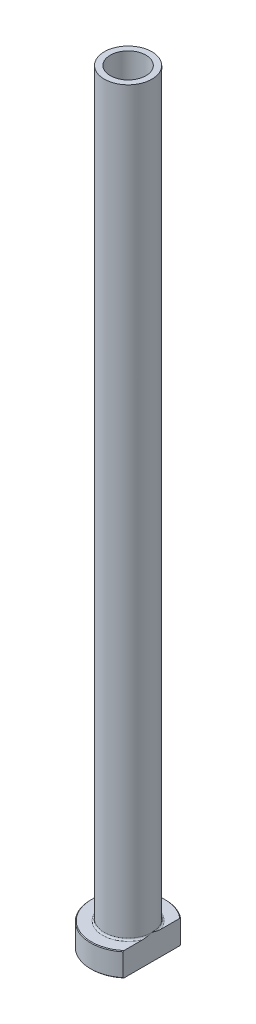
ISO-10303-21;
HEADER;
FILE_DESCRIPTION(('STEP AP214'),'2;1');
FILE_NAME('part.step','',(''),(''),'','','');
FILE_SCHEMA(('AUTOMOTIVE_DESIGN { 1 0 10303 214 1 1 1 1 }'));
ENDSEC;
DATA;
#1=APPLICATION_CONTEXT('core data for automotive mechanical design processes');
#2=APPLICATION_PROTOCOL_DEFINITION('international standard','automotive_design',2000,#1);
#3=PRODUCT_CONTEXT('',#1,'mechanical');
#4=PRODUCT('Part','Part','',(#3));
#5=PRODUCT_RELATED_PRODUCT_CATEGORY('part','',(#4));
#6=PRODUCT_DEFINITION_FORMATION('','',#4);
#7=PRODUCT_DEFINITION_CONTEXT('part definition',#1,'design');
#8=PRODUCT_DEFINITION('design','',#6,#7);
#9=PRODUCT_DEFINITION_SHAPE('','',#8);
#10=(LENGTH_UNIT() NAMED_UNIT(*) SI_UNIT(.MILLI.,.METRE.));
#11=(NAMED_UNIT(*) PLANE_ANGLE_UNIT() SI_UNIT($,.RADIAN.));
#12=(NAMED_UNIT(*) SI_UNIT($,.STERADIAN.) SOLID_ANGLE_UNIT());
#13=UNCERTAINTY_MEASURE_WITH_UNIT(LENGTH_MEASURE(1.E-05),#10,'distance_accuracy_value','');
#14=(GEOMETRIC_REPRESENTATION_CONTEXT(3) GLOBAL_UNCERTAINTY_ASSIGNED_CONTEXT((#13)) GLOBAL_UNIT_ASSIGNED_CONTEXT((#10,
#11,#12)) REPRESENTATION_CONTEXT('',''));
#15=CARTESIAN_POINT('',(0.,0.,0.));
#16=DIRECTION('',(0.,0.,1.));
#17=DIRECTION('',(1.,0.,0.));
#18=AXIS2_PLACEMENT_3D('',#15,#16,#17);
#19=CARTESIAN_POINT('',(0.,92.1876809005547,0.));
#20=DIRECTION('',(0.,1.,0.));
#21=DIRECTION('',(0.,0.,1.));
#22=AXIS2_PLACEMENT_3D('',#19,#20,#21);
#23=CYLINDRICAL_SURFACE('',#22,5.25000000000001);
#24=CARTESIAN_POINT('',(0.,225.,0.));
#25=DIRECTION('',(0.,1.,0.));
#26=DIRECTION('',(0.,0.,1.));
#27=AXIS2_PLACEMENT_3D('',#24,#25,#26);
#28=CIRCLE('',#27,5.25000000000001);
#29=CARTESIAN_POINT('',(0.,225.,5.25000000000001));
#30=VERTEX_POINT('',#29);
#31=EDGE_CURVE('E167',#30,#30,#28,.T.);
#32=ORIENTED_EDGE('',*,*,#31,.T.);
#33=EDGE_LOOP('',(#32));
#34=FACE_BOUND('',#33,.T.);
#35=CARTESIAN_POINT('',(0.,170.,0.));
#36=DIRECTION('',(0.,1.,0.));
#37=DIRECTION('',(0.,0.,1.));
#38=AXIS2_PLACEMENT_3D('',#35,#36,#37);
#39=CIRCLE('',#38,5.25000000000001);
#40=CARTESIAN_POINT('',(0.,170.,5.25000000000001));
#41=VERTEX_POINT('',#40);
#42=EDGE_CURVE('E170',#41,#41,#39,.T.);
#43=ORIENTED_EDGE('',*,*,#42,.F.);
#44=EDGE_LOOP('',(#43));
#45=FACE_BOUND('',#44,.T.);
#46=ADVANCED_FACE('F32',(#34,#45),#23,.F.);
#47=CARTESIAN_POINT('',(-5.25000000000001,225.,0.));
#48=DIRECTION('',(0.,1.,0.));
#49=DIRECTION('',(0.,0.,1.));
#50=AXIS2_PLACEMENT_3D('',#47,#48,#49);
#51=PLANE('',#50);
#52=CARTESIAN_POINT('',(0.,225.,0.));
#53=DIRECTION('',(0.,1.,0.));
#54=DIRECTION('',(0.,0.,1.));
#55=AXIS2_PLACEMENT_3D('',#52,#53,#54);
#56=CIRCLE('',#55,7.00000000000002);
#57=CARTESIAN_POINT('',(0.,225.,7.00000000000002));
#58=VERTEX_POINT('',#57);
#59=EDGE_CURVE('E174',#58,#58,#56,.T.);
#60=ORIENTED_EDGE('',*,*,#59,.T.);
#61=EDGE_LOOP('',(#60));
#62=FACE_BOUND('',#61,.T.);
#63=ORIENTED_EDGE('',*,*,#31,.F.);
#64=EDGE_LOOP('',(#63));
#65=FACE_BOUND('',#64,.T.);
#66=ADVANCED_FACE('F157',(#62,#65),#51,.T.);
#67=CARTESIAN_POINT('',(0.,92.1876809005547,0.));
#68=DIRECTION('',(0.,1.,0.));
#69=DIRECTION('',(0.,0.,1.));
#70=AXIS2_PLACEMENT_3D('',#67,#68,#69);
#71=CYLINDRICAL_SURFACE('',#70,7.);
#72=CARTESIAN_POINT('',(0.,7.50000000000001,0.));
#73=DIRECTION('',(0.,1.,0.));
#74=DIRECTION('',(0.,0.,1.));
#75=AXIS2_PLACEMENT_3D('',#72,#73,#74);
#76=CIRCLE('',#75,7.);
#77=CARTESIAN_POINT('',(7.,7.50000000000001,0.));
#78=VERTEX_POINT('',#77);
#79=EDGE_CURVE('E180',#78,#78,#76,.T.);
#80=ORIENTED_EDGE('',*,*,#79,.T.);
#81=EDGE_LOOP('',(#80));
#82=FACE_BOUND('',#81,.T.);
#83=ORIENTED_EDGE('',*,*,#59,.F.);
#84=EDGE_LOOP('',(#83));
#85=FACE_BOUND('',#84,.T.);
#86=ADVANCED_FACE('F162',(#82,#85),#71,.T.);
#87=CARTESIAN_POINT('',(-6.99999999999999,7.,0.));
#88=DIRECTION('',(0.,1.,0.));
#89=DIRECTION('',(0.,0.,1.));
#90=AXIS2_PLACEMENT_3D('',#87,#88,#89);
#91=PLANE('',#90);
#92=DIRECTION('',(0.,0.,1.));
#93=VECTOR('',#92,1.);
#94=CARTESIAN_POINT('',(6.99999999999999,7.,0.));
#95=LINE('',#94,#93);
#96=CARTESIAN_POINT('',(7.,7.,-8.22435407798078));
#97=VERTEX_POINT('',#96);
#98=CARTESIAN_POINT('',(6.99999999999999,7.,-2.69258240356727));
#99=VERTEX_POINT('',#98);
#100=EDGE_CURVE('E54',#97,#99,#95,.T.);
#101=ORIENTED_EDGE('',*,*,#100,.F.);
#102=CARTESIAN_POINT('',(0.,7.,0.));
#103=DIRECTION('',(0.,1.,0.));
#104=DIRECTION('',(0.,0.,1.));
#105=AXIS2_PLACEMENT_3D('',#102,#103,#104);
#106=CIRCLE('',#105,10.8);
#107=CARTESIAN_POINT('',(6.99999999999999,7.,8.22435407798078));
#108=VERTEX_POINT('',#107);
#109=EDGE_CURVE('E186',#97,#108,#106,.T.);
#110=ORIENTED_EDGE('',*,*,#109,.T.);
#111=CARTESIAN_POINT('',(6.99999999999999,7.,2.69258240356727));
#112=VERTEX_POINT('',#111);
#113=EDGE_CURVE('E134',#112,#108,#95,.T.);
#114=ORIENTED_EDGE('',*,*,#113,.F.);
#115=CARTESIAN_POINT('',(0.,7.,0.));
#116=DIRECTION('',(0.,1.,0.));
#117=DIRECTION('',(0.,0.,1.));
#118=AXIS2_PLACEMENT_3D('',#115,#116,#117);
#119=CIRCLE('',#118,7.5);
#120=EDGE_CURVE('E183',#112,#99,#119,.F.);
#121=ORIENTED_EDGE('',*,*,#120,.T.);
#122=EDGE_LOOP('',(#101,#110,#114,#121));
#123=FACE_BOUND('',#122,.T.);
#124=ADVANCED_FACE('F197',(#123),#91,.T.);
#125=CARTESIAN_POINT('',(0.,92.1876809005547,0.));
#126=DIRECTION('',(0.,1.,0.));
#127=DIRECTION('',(0.,0.,1.));
#128=AXIS2_PLACEMENT_3D('',#125,#126,#127);
#129=CYLINDRICAL_SURFACE('',#128,11.);
#130=DIRECTION('',(0.,-1.,0.));
#131=VECTOR('',#130,1.);
#132=CARTESIAN_POINT('',(6.99999999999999,225.,8.48528137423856));
#133=LINE('',#132,#131);
#134=CARTESIAN_POINT('',(6.99999999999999,6.79999999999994,8.48528137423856));
#135=VERTEX_POINT('',#134);
#136=CARTESIAN_POINT('',(6.99999999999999,0.200000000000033,8.48528137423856));
#137=VERTEX_POINT('',#136);
#138=EDGE_CURVE('E82',#135,#137,#133,.T.);
#139=ORIENTED_EDGE('',*,*,#138,.F.);
#140=CARTESIAN_POINT('',(0.,6.79999999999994,0.));
#141=DIRECTION('',(0.,1.,0.));
#142=DIRECTION('',(0.,0.,1.));
#143=AXIS2_PLACEMENT_3D('',#140,#141,#142);
#144=CIRCLE('',#143,11.);
#145=CARTESIAN_POINT('',(7.,6.79999999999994,-8.48528137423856));
#146=VERTEX_POINT('',#145);
#147=EDGE_CURVE('E95',#135,#146,#144,.F.);
#148=ORIENTED_EDGE('',*,*,#147,.T.);
#149=DIRECTION('',(0.,-1.,0.));
#150=VECTOR('',#149,1.);
#151=CARTESIAN_POINT('',(7.,225.,-8.48528137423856));
#152=LINE('',#151,#150);
#153=CARTESIAN_POINT('',(7.,0.200000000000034,-8.48528137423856));
#154=VERTEX_POINT('',#153);
#155=EDGE_CURVE('E192',#146,#154,#152,.T.);
#156=ORIENTED_EDGE('',*,*,#155,.T.);
#157=CARTESIAN_POINT('',(0.,0.200000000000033,0.));
#158=DIRECTION('',(0.,-1.,0.));
#159=DIRECTION('',(0.,0.,-1.));
#160=AXIS2_PLACEMENT_3D('',#157,#158,#159);
#161=CIRCLE('',#160,11.);
#162=EDGE_CURVE('E98',#154,#137,#161,.F.);
#163=ORIENTED_EDGE('',*,*,#162,.T.);
#164=EDGE_LOOP('',(#139,#148,#156,#163));
#165=FACE_BOUND('',#164,.T.);
#166=ADVANCED_FACE('F190',(#165),#129,.T.);
#167=CARTESIAN_POINT('',(-11.,0.,0.));
#168=DIRECTION('',(0.,-1.,0.));
#169=DIRECTION('',(0.,0.,-1.));
#170=AXIS2_PLACEMENT_3D('',#167,#168,#169);
#171=PLANE('',#170);
#172=CARTESIAN_POINT('',(0.,0.,0.));
#173=DIRECTION('',(0.,-1.,0.));
#174=DIRECTION('',(0.,0.,-1.));
#175=AXIS2_PLACEMENT_3D('',#172,#173,#174);
#176=CIRCLE('',#175,5.99999999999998);
#177=CARTESIAN_POINT('',(0.,0.,-5.99999999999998));
#178=VERTEX_POINT('',#177);
#179=EDGE_CURVE('E40',#178,#178,#176,.F.);
#180=ORIENTED_EDGE('',*,*,#179,.T.);
#181=EDGE_LOOP('',(#180));
#182=FACE_BOUND('',#181,.T.);
#183=DIRECTION('',(0.,0.,-1.));
#184=VECTOR('',#183,1.);
#185=CARTESIAN_POINT('',(6.99999999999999,0.,8.48528137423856));
#186=LINE('',#185,#184);
#187=CARTESIAN_POINT('',(6.99999999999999,0.,8.22435407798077));
#188=VERTEX_POINT('',#187);
#189=CARTESIAN_POINT('',(7.,0.,-8.22435407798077));
#190=VERTEX_POINT('',#189);
#191=EDGE_CURVE('E47',#188,#190,#186,.T.);
#192=ORIENTED_EDGE('',*,*,#191,.F.);
#193=CARTESIAN_POINT('',(0.,0.,0.));
#194=DIRECTION('',(0.,-1.,0.));
#195=DIRECTION('',(0.,0.,-1.));
#196=AXIS2_PLACEMENT_3D('',#193,#194,#195);
#197=CIRCLE('',#196,10.7999999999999);
#198=EDGE_CURVE('E92',#188,#190,#197,.T.);
#199=ORIENTED_EDGE('',*,*,#198,.T.);
#200=EDGE_LOOP('',(#192,#199));
#201=FACE_BOUND('',#200,.T.);
#202=ADVANCED_FACE('F91',(#182,#201),#171,.T.);
#203=CARTESIAN_POINT('',(0.,92.1876809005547,0.));
#204=DIRECTION('',(0.,1.,0.));
#205=DIRECTION('',(0.,0.,1.));
#206=AXIS2_PLACEMENT_3D('',#203,#204,#205);
#207=CYLINDRICAL_SURFACE('',#206,5.5);
#208=CARTESIAN_POINT('',(0.,0.499999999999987,0.));
#209=DIRECTION('',(0.,-1.,0.));
#210=DIRECTION('',(0.,0.,-1.));
#211=AXIS2_PLACEMENT_3D('',#208,#209,#210);
#212=CIRCLE('',#211,5.5);
#213=CARTESIAN_POINT('',(0.,0.499999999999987,-5.5));
#214=VERTEX_POINT('',#213);
#215=EDGE_CURVE('E11',#214,#214,#212,.T.);
#216=ORIENTED_EDGE('',*,*,#215,.T.);
#217=EDGE_LOOP('',(#216));
#218=FACE_BOUND('',#217,.T.);
#219=CARTESIAN_POINT('',(0.,158.,0.));
#220=DIRECTION('',(0.,1.,0.));
#221=DIRECTION('',(0.,0.,1.));
#222=AXIS2_PLACEMENT_3D('',#219,#220,#221);
#223=CIRCLE('',#222,5.50000000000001);
#224=CARTESIAN_POINT('',(0.,158.,5.50000000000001));
#225=VERTEX_POINT('',#224);
#226=EDGE_CURVE('E172',#225,#225,#223,.T.);
#227=ORIENTED_EDGE('',*,*,#226,.T.);
#228=EDGE_LOOP('',(#227));
#229=FACE_BOUND('',#228,.T.);
#230=ADVANCED_FACE('F215',(#218,#229),#207,.F.);
#231=CARTESIAN_POINT('',(0.,158.,0.));
#232=DIRECTION('',(0.,-1.,0.));
#233=DIRECTION('',(0.,0.,-1.));
#234=AXIS2_PLACEMENT_3D('',#231,#232,#233);
#235=CONICAL_SURFACE('',#234,5.50000000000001,0.0208303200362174);
#236=ORIENTED_EDGE('',*,*,#42,.T.);
#237=EDGE_LOOP('',(#236));
#238=FACE_BOUND('',#237,.T.);
#239=ORIENTED_EDGE('',*,*,#226,.F.);
#240=EDGE_LOOP('',(#239));
#241=FACE_BOUND('',#240,.T.);
#242=ADVANCED_FACE('F111',(#238,#241),#235,.F.);
#243=CARTESIAN_POINT('',(0.,7.50000000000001,0.));
#244=DIRECTION('',(0.,1.,0.));
#245=DIRECTION('',(0.,0.,1.));
#246=AXIS2_PLACEMENT_3D('',#243,#244,#245);
#247=TOROIDAL_SURFACE('',#246,7.5,0.5);
#248=ORIENTED_EDGE('',*,*,#120,.F.);
#249=CARTESIAN_POINT('',(7.,7.50000000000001,0.));
#250=CARTESIAN_POINT('',(7.,7.50000080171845,-1.25567863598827E-10));
#251=CARTESIAN_POINT('',(7.,7.50000160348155,2.90220364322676E-07));
#252=CARTESIAN_POINT('',(7.,7.50000310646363,1.10846461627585E-06));
#253=CARTESIAN_POINT('',(7.,7.50000379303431,1.6547013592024E-06));
#254=CARTESIAN_POINT('',(7.,7.5000052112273,2.9610278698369E-06));
#255=CARTESIAN_POINT('',(7.,7.50000592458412,3.74204219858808E-06));
#256=CARTESIAN_POINT('',(7.,7.50000721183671,5.3689192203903E-06));
#257=CARTESIAN_POINT('',(7.,7.50000778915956,6.21226390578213E-06));
#258=CARTESIAN_POINT('',(7.,7.5000099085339,9.44889779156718E-06));
#259=CARTESIAN_POINT('',(7.,7.50001133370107,1.19224923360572E-05));
#260=CARTESIAN_POINT('',(7.,7.50001370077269,1.68453059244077E-05));
#261=CARTESIAN_POINT('',(7.,7.50001467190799,1.92810872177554E-05));
#262=CARTESIAN_POINT('',(7.,7.50001870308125,2.95057541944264E-05));
#263=CARTESIAN_POINT('',(7.,7.50002167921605,3.73333844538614E-05));
#264=CARTESIAN_POINT('',(7.,7.50002610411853,5.21820440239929E-05));
#265=CARTESIAN_POINT('',(7.,7.50002771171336,5.91556038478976E-05));
#266=CARTESIAN_POINT('',(7.,7.50003935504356,0.000110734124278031));
#267=CARTESIAN_POINT('',(7.,7.50004810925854,0.000155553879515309));
#268=CARTESIAN_POINT('',(6.99999999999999,7.50008643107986,0.000332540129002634));
#269=CARTESIAN_POINT('',(6.99999999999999,7.50012307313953,0.000463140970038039));
#270=CARTESIAN_POINT('',(7.,7.50026565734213,0.000980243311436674));
#271=CARTESIAN_POINT('',(7.,7.50036696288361,0.00136762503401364));
#272=CARTESIAN_POINT('',(6.99999999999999,7.5007725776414,0.00290683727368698));
#273=CARTESIAN_POINT('',(6.99999999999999,7.50108269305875,0.00405753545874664));
#274=CARTESIAN_POINT('',(7.,7.50237341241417,0.00885983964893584));
#275=CARTESIAN_POINT('',(7.,7.50334676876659,0.0125128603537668));
#276=CARTESIAN_POINT('',(6.99999999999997,7.51627189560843,0.0610038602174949));
#277=CARTESIAN_POINT('',(6.99999999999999,7.52827280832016,0.105832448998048));
#278=CARTESIAN_POINT('',(7.,7.55170994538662,0.193693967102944));
#279=CARTESIAN_POINT('',(7.,7.56314936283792,0.236726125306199));
#280=CARTESIAN_POINT('',(6.99999999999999,7.58740418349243,0.328321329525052));
#281=CARTESIAN_POINT('',(6.99999999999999,7.6002083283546,0.3768874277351));
#282=CARTESIAN_POINT('',(7.,7.62578161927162,0.474605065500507));
#283=CARTESIAN_POINT('',(7.,7.63854879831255,0.523757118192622));
#284=CARTESIAN_POINT('',(7.,7.66904753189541,0.642366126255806));
#285=CARTESIAN_POINT('',(7.,7.68665961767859,0.711854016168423));
#286=CARTESIAN_POINT('',(7.,7.72074501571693,0.849103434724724));
#287=CARTESIAN_POINT('',(7.,7.73723627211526,0.916860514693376));
#288=CARTESIAN_POINT('',(7.,7.79038156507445,1.14104210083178));
#289=CARTESIAN_POINT('',(7.,7.82528973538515,1.29788860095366));
#290=CARTESIAN_POINT('',(7.,7.88862298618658,1.61471917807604));
#291=CARTESIAN_POINT('',(7.,7.91697354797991,1.77471883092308));
#292=CARTESIAN_POINT('',(7.,7.95258292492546,2.02253505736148));
#293=CARTESIAN_POINT('',(7.,7.96355251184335,2.10981398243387));
#294=CARTESIAN_POINT('',(7.,7.98165287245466,2.28476193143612));
#295=CARTESIAN_POINT('',(7.,7.98878459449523,2.372430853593));
#296=CARTESIAN_POINT('',(7.,7.99822919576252,2.54760327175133));
#297=CARTESIAN_POINT('',(7.,8.00056589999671,2.63510541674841));
#298=CARTESIAN_POINT('',(7.,7.99919996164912,2.81004074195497));
#299=CARTESIAN_POINT('',(7.,7.99550272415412,2.8974739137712));
#300=CARTESIAN_POINT('',(7.,7.98391011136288,3.02882076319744));
#301=CARTESIAN_POINT('',(7.,7.97897237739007,3.07299684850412));
#302=CARTESIAN_POINT('',(7.,7.96665453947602,3.16105400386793));
#303=CARTESIAN_POINT('',(7.,7.95927246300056,3.20493480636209));
#304=CARTESIAN_POINT('',(7.,7.94168688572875,3.29163191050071));
#305=CARTESIAN_POINT('',(7.,7.93151559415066,3.33445462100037));
#306=CARTESIAN_POINT('',(7.,7.90768392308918,3.41909658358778));
#307=CARTESIAN_POINT('',(7.,7.89402748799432,3.46091691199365));
#308=CARTESIAN_POINT('',(7.,7.86214701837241,3.5433177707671));
#309=CARTESIAN_POINT('',(7.,7.84387618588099,3.58388050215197));
#310=CARTESIAN_POINT('',(7.,7.80145892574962,3.66184445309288));
#311=CARTESIAN_POINT('',(7.,7.77733569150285,3.69925738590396));
#312=CARTESIAN_POINT('',(7.,7.73714014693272,3.74836513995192));
#313=CARTESIAN_POINT('',(7.,7.7242320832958,3.76263695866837));
#314=CARTESIAN_POINT('',(7.,7.69673765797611,3.78951670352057));
#315=CARTESIAN_POINT('',(7.,7.68215013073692,3.8021234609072));
#316=CARTESIAN_POINT('',(7.,7.65099843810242,3.82514624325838));
#317=CARTESIAN_POINT('',(7.,7.6344104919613,3.83553078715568));
#318=CARTESIAN_POINT('',(7.,7.59955798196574,3.85294010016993));
#319=CARTESIAN_POINT('',(7.,7.58129885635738,3.85997533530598));
#320=CARTESIAN_POINT('',(7.,7.54906837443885,3.86837810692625));
#321=CARTESIAN_POINT('',(7.,7.53536870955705,3.87079233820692));
#322=CARTESIAN_POINT('',(7.,7.50775756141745,3.87325240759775));
#323=CARTESIAN_POINT('',(7.,7.49384618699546,3.87329942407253));
#324=CARTESIAN_POINT('',(7.,7.46623771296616,3.87102093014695));
#325=CARTESIAN_POINT('',(7.,7.45254041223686,3.8686978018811));
#326=CARTESIAN_POINT('',(7.,7.42569741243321,3.86188775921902));
#327=CARTESIAN_POINT('',(7.,7.41255212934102,3.85739924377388));
#328=CARTESIAN_POINT('',(7.,7.38259319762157,3.84468786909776));
#329=CARTESIAN_POINT('',(7.,7.36610215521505,3.83570823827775));
#330=CARTESIAN_POINT('',(7.,7.33476729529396,3.81523202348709));
#331=CARTESIAN_POINT('',(7.,7.31992737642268,3.80372966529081));
#332=CARTESIAN_POINT('',(7.,7.28371925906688,3.77170797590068));
#333=CARTESIAN_POINT('',(7.,7.26356272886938,3.7498305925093));
#334=CARTESIAN_POINT('',(7.,7.22671696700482,3.70338283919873));
#335=CARTESIAN_POINT('',(7.,7.21003361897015,3.67880800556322));
#336=CARTESIAN_POINT('',(7.,7.18026553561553,3.6292173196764));
#337=CARTESIAN_POINT('',(7.,7.16704475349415,3.60428175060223));
#338=CARTESIAN_POINT('',(7.,7.1427506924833,3.55337478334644));
#339=CARTESIAN_POINT('',(7.,7.13167947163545,3.52740242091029));
#340=CARTESIAN_POINT('',(7.,7.10104499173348,3.44809573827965));
#341=CARTESIAN_POINT('',(7.,7.08424174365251,3.39369851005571));
#342=CARTESIAN_POINT('',(7.,7.05431378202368,3.27667221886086));
#343=CARTESIAN_POINT('',(7.,7.04191718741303,3.21386807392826));
#344=CARTESIAN_POINT('',(7.,7.02234605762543,3.08735184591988));
#345=CARTESIAN_POINT('',(7.,7.01518234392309,3.02363815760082));
#346=CARTESIAN_POINT('',(7.,7.00517826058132,2.89779001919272));
#347=CARTESIAN_POINT('',(7.,7.00221627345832,2.83566460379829));
#348=CARTESIAN_POINT('',(7.,6.99952325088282,2.71160626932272));
#349=CARTESIAN_POINT('',(7.,6.99977918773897,2.64967358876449));
#350=CARTESIAN_POINT('',(7.,7.00377761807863,2.49407814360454));
#351=CARTESIAN_POINT('',(7.,7.00924384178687,2.40046113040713));
#352=CARTESIAN_POINT('',(7.,7.02494106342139,2.21367396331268));
#353=CARTESIAN_POINT('',(7.,7.03517106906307,2.12050372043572));
#354=CARTESIAN_POINT('',(7.,7.05969765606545,1.93249035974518));
#355=CARTESIAN_POINT('',(7.,7.0740838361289,1.8376591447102));
#356=CARTESIAN_POINT('',(7.,7.10603300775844,1.64829340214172));
#357=CARTESIAN_POINT('',(7.,7.12360402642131,1.55376025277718));
#358=CARTESIAN_POINT('',(7.,7.16806468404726,1.3308610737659));
#359=CARTESIAN_POINT('',(7.,7.19601783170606,1.20270896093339));
#360=CARTESIAN_POINT('',(7.,7.25475947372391,0.948586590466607));
#361=CARTESIAN_POINT('',(7.,7.28551257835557,0.822607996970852));
#362=CARTESIAN_POINT('',(7.,7.33123897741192,0.641334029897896));
#363=CARTESIAN_POINT('',(6.99999999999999,7.34543722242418,0.585840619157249));
#364=CARTESIAN_POINT('',(7.,7.37418243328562,0.474686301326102));
#365=CARTESIAN_POINT('',(7.,7.38873064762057,0.419025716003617));
#366=CARTESIAN_POINT('',(6.99999999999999,7.41873357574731,0.305011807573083));
#367=CARTESIAN_POINT('',(6.99999999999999,7.43419762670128,0.246660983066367));
#368=CARTESIAN_POINT('',(7.00000000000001,7.46502361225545,0.130933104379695));
#369=CARTESIAN_POINT('',(7.00000000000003,7.48038319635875,0.0735554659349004));
#370=CARTESIAN_POINT('',(6.99999999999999,7.49665455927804,0.0125077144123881));
#371=CARTESIAN_POINT('',(6.99999999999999,7.49762931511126,0.00884956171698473));
#372=CARTESIAN_POINT('',(7.,7.49892036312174,0.00404608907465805));
#373=CARTESIAN_POINT('',(7.,7.49922940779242,0.00289935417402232));
#374=CARTESIAN_POINT('',(6.99999999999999,7.49963371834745,0.00136508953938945));
#375=CARTESIAN_POINT('',(6.99999999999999,7.49973476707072,0.000978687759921));
#376=CARTESIAN_POINT('',(7.,7.49987704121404,0.000462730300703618));
#377=CARTESIAN_POINT('',(7.,7.49991363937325,0.00033229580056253));
#378=CARTESIAN_POINT('',(6.99999999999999,7.49995192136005,0.000155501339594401));
#379=CARTESIAN_POINT('',(6.99999999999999,7.49996067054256,0.000110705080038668));
#380=CARTESIAN_POINT('',(7.,7.49997230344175,5.91504889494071E-05));
#381=CARTESIAN_POINT('',(7.,7.49997390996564,5.21782496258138E-05));
#382=CARTESIAN_POINT('',(7.,7.49997833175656,3.7332283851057E-05));
#383=CARTESIAN_POINT('',(7.,7.49998130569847,2.95059567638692E-05));
#384=CARTESIAN_POINT('',(7.,7.49998533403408,1.92826364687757E-05));
#385=CARTESIAN_POINT('',(7.,7.49998630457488,1.68469539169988E-05));
#386=CARTESIAN_POINT('',(7.,7.49998867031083,1.19242386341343E-05));
#387=CARTESIAN_POINT('',(7.,7.49999009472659,9.45063158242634E-06));
#388=CARTESIAN_POINT('',(7.,7.49999221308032,6.21386512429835E-06));
#389=CARTESIAN_POINT('',(7.,7.49999279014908,5.37045374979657E-06));
#390=CARTESIAN_POINT('',(7.,7.49999407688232,3.74339748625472E-06));
#391=CARTESIAN_POINT('',(7.,7.49999478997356,2.96226905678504E-06));
#392=CARTESIAN_POINT('',(7.,7.49999620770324,1.65567377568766E-06));
#393=CARTESIAN_POINT('',(7.,7.49999689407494,1.1092922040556E-06));
#394=CARTESIAN_POINT('',(7.,7.49999839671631,2.90683297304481E-07));
#395=CARTESIAN_POINT('',(7.,7.49999919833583,1.25560794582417E-10));
#396=CARTESIAN_POINT('',(7.,7.50000000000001,0.));
#397=B_SPLINE_CURVE_WITH_KNOTS('',3,(#249,#250,#251,#252,#253,#254,#255,#256,#257,#258,#259,
#260,#261,#262,#263,#264,#265,#266,#267,#268,#269,#270,#271,#272,#273,#274,#275,#276,#277,#278,
#279,#280,#281,#282,#283,#284,#285,#286,#287,#288,#289,#290,#291,#292,#293,#294,#295,#296,#297,
#298,#299,#300,#301,#302,#303,#304,#305,#306,#307,#308,#309,#310,#311,#312,#313,#314,#315,#316,
#317,#318,#319,#320,#321,#322,#323,#324,#325,#326,#327,#328,#329,#330,#331,#332,#333,#334,#335,
#336,#337,#338,#339,#340,#341,#342,#343,#344,#345,#346,#347,#348,#349,#350,#351,#352,#353,#354,
#355,#356,#357,#358,#359,#360,#361,#362,#363,#364,#365,#366,#367,#368,#369,#370,#371,#372,#373,
#374,#375,#376,#377,#378,#379,#380,#381,#382,#383,#384,#385,#386,#387,#388,#389,#390,#391,#392,
#393,#394,#395,#396),.UNSPECIFIED.,.T.,.F.,(4,2,2,2,2,2,2,2,2,2,2,2,2,2,2,2,2,2,2,2,2,2,2,2,2,2,
2,2,2,2,2,2,2,2,2,2,2,2,2,2,2,2,2,2,2,2,2,2,2,2,2,2,2,2,2,2,2,2,2,2,2,2,2,2,2,2,2,2,2,2,2,2,2,
4),(0.,2.42201289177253E-06,5.05304625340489E-06,8.20813802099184E-06,1.12722893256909E-05,
1.98043973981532E-05,2.76642009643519E-05,5.27403794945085E-05,7.41830718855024E-05,
0.000211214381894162,0.000617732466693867,0.00181938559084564,0.0053941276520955,
0.0167361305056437,0.155952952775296,0.289534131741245,0.440210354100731,0.592559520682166,
0.807611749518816,1.01681499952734,1.49878389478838,1.98598665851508,2.24981935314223,
2.51358682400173,2.77604050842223,3.03825922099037,3.17156039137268,3.30496939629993,
3.43689837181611,3.56867869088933,3.70185328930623,3.83450849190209,3.89212877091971,
3.94978928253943,4.00821928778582,4.06646549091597,4.10801107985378,4.14953598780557,
4.19101920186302,4.23253313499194,4.28854866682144,4.34469377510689,4.43343413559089,
4.52232362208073,4.60686785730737,4.69149264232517,4.86185145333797,5.05362927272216,
5.245802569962,5.43229132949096,5.6180253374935,5.89918385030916,6.18028382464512,
6.46796485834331,6.75638131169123,7.14981284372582,7.53882346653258,7.71066604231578,
7.88325629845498,8.06435328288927,8.24254095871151,8.25389891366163,8.25746134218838,
8.25865995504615,8.2590659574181,8.25920291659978,8.25922435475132,8.25924942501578,
8.25925728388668,8.25926581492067,8.25926887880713,8.25927203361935,8.25927466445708,
8.25927708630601),.UNSPECIFIED.);
#398=EDGE_CURVE('E126',#112,#78,#397,.T.);
#399=ORIENTED_EDGE('',*,*,#398,.T.);
#400=ORIENTED_EDGE('',*,*,#79,.F.);
#401=CARTESIAN_POINT('',(7.,7.50000000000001,0.));
#402=CARTESIAN_POINT('',(7.,7.49999919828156,1.25569444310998E-10));
#403=CARTESIAN_POINT('',(7.,7.49999839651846,-2.90220362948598E-07));
#404=CARTESIAN_POINT('',(7.,7.49999689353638,-1.10846461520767E-06));
#405=CARTESIAN_POINT('',(7.,7.49999620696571,-1.6547013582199E-06));
#406=CARTESIAN_POINT('',(7.,7.49999478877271,-2.96102786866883E-06));
#407=CARTESIAN_POINT('',(7.,7.49999407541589,-3.74204219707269E-06));
#408=CARTESIAN_POINT('',(7.,7.49999278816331,-5.3689192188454E-06));
#409=CARTESIAN_POINT('',(7.,7.49999221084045,-6.21226390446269E-06));
#410=CARTESIAN_POINT('',(7.,7.49999009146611,-9.44889779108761E-06));
#411=CARTESIAN_POINT('',(7.,7.49998866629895,-1.19224923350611E-05));
#412=CARTESIAN_POINT('',(7.,7.49998629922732,-1.68453059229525E-05));
#413=CARTESIAN_POINT('',(7.,7.49998532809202,-1.92810872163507E-05));
#414=CARTESIAN_POINT('',(7.,7.49998129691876,-2.95057541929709E-05));
#415=CARTESIAN_POINT('',(7.,7.49997832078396,-3.73333844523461E-05));
#416=CARTESIAN_POINT('',(7.,7.49997389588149,-5.2182044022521E-05));
#417=CARTESIAN_POINT('',(7.,7.49997228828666,-5.91556038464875E-05));
#418=CARTESIAN_POINT('',(6.99999999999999,7.49996064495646,-0.000110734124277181));
#419=CARTESIAN_POINT('',(6.99999999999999,7.49995189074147,-0.000155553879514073));
#420=CARTESIAN_POINT('',(7.,7.49991356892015,-0.000332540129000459));
#421=CARTESIAN_POINT('',(7.,7.49987692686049,-0.000463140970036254));
#422=CARTESIAN_POINT('',(6.99999999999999,7.49973434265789,-0.000980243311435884));
#423=CARTESIAN_POINT('',(6.99999999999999,7.4996330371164,-0.00136762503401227));
#424=CARTESIAN_POINT('',(7.,7.49922742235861,-0.00290683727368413));
#425=CARTESIAN_POINT('',(7.,7.49891730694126,-0.00405753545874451));
#426=CARTESIAN_POINT('',(6.99999999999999,7.49762658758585,-0.00885983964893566));
#427=CARTESIAN_POINT('',(6.99999999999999,7.49665323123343,-0.012512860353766));
#428=CARTESIAN_POINT('',(7.00000000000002,7.48372810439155,-0.0610038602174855));
#429=CARTESIAN_POINT('',(7.,7.47172719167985,-0.105832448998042));
#430=CARTESIAN_POINT('',(6.99999999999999,7.4482900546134,-0.193693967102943));
#431=CARTESIAN_POINT('',(6.99999999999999,7.4368506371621,-0.236726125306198));
#432=CARTESIAN_POINT('',(7.,7.41259581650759,-0.328321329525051));
#433=CARTESIAN_POINT('',(7.,7.39979167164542,-0.376887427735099));
#434=CARTESIAN_POINT('',(6.99999999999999,7.3742183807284,-0.474605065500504));
#435=CARTESIAN_POINT('',(7.,7.36145120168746,-0.523757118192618));
#436=CARTESIAN_POINT('',(7.,7.3309524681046,-0.642366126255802));
#437=CARTESIAN_POINT('',(7.,7.31334038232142,-0.711854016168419));
#438=CARTESIAN_POINT('',(7.,7.27925498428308,-0.849103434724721));
#439=CARTESIAN_POINT('',(7.,7.26276372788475,-0.916860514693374));
#440=CARTESIAN_POINT('',(7.,7.20961843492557,-1.14104210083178));
#441=CARTESIAN_POINT('',(7.,7.17471026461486,-1.29788860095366));
#442=CARTESIAN_POINT('',(7.,7.11137701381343,-1.61471917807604));
#443=CARTESIAN_POINT('',(7.,7.0830264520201,-1.77471883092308));
#444=CARTESIAN_POINT('',(7.,7.04741707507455,-2.02253505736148));
#445=CARTESIAN_POINT('',(7.,7.03644748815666,-2.10981398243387));
#446=CARTESIAN_POINT('',(7.,7.01834712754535,-2.28476193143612));
#447=CARTESIAN_POINT('',(7.,7.01121540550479,-2.372430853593));
#448=CARTESIAN_POINT('',(7.,7.00177080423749,-2.54760327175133));
#449=CARTESIAN_POINT('',(7.,6.9994341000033,-2.63510541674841));
#450=CARTESIAN_POINT('',(7.,7.00080003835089,-2.81004074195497));
#451=CARTESIAN_POINT('',(7.,7.00449727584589,-2.8974739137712));
#452=CARTESIAN_POINT('',(7.,7.01608988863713,-3.02882076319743));
#453=CARTESIAN_POINT('',(7.,7.02102762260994,-3.07299684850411));
#454=CARTESIAN_POINT('',(7.,7.03334546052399,-3.16105400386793));
#455=CARTESIAN_POINT('',(7.,7.04072753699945,-3.20493480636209));
#456=CARTESIAN_POINT('',(7.,7.05831311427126,-3.2916319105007));
#457=CARTESIAN_POINT('',(7.,7.06848440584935,-3.33445462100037));
#458=CARTESIAN_POINT('',(7.,7.09231607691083,-3.41909658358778));
#459=CARTESIAN_POINT('',(7.,7.10597251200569,-3.46091691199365));
#460=CARTESIAN_POINT('',(7.,7.13785298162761,-3.5433177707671));
#461=CARTESIAN_POINT('',(7.,7.15612381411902,-3.58388050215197));
#462=CARTESIAN_POINT('',(7.,7.1985410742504,-3.66184445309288));
#463=CARTESIAN_POINT('',(7.,7.22266430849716,-3.69925738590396));
#464=CARTESIAN_POINT('',(7.,7.2628598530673,-3.74836513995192));
#465=CARTESIAN_POINT('',(7.,7.27576791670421,-3.76263695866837));
#466=CARTESIAN_POINT('',(7.,7.3032623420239,-3.78951670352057));
#467=CARTESIAN_POINT('',(7.,7.3178498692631,-3.8021234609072));
#468=CARTESIAN_POINT('',(7.,7.34900156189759,-3.82514624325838));
#469=CARTESIAN_POINT('',(7.,7.36558950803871,-3.83553078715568));
#470=CARTESIAN_POINT('',(7.,7.40044201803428,-3.85294010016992));
#471=CARTESIAN_POINT('',(7.,7.41870114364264,-3.85997533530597));
#472=CARTESIAN_POINT('',(7.,7.45093162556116,-3.86837810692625));
#473=CARTESIAN_POINT('',(7.,7.46463129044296,-3.87079233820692));
#474=CARTESIAN_POINT('',(7.,7.49224243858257,-3.87325240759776));
#475=CARTESIAN_POINT('',(7.,7.50615381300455,-3.87329942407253));
#476=CARTESIAN_POINT('',(7.,7.53376228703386,-3.87102093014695));
#477=CARTESIAN_POINT('',(7.,7.54745958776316,-3.8686978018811));
#478=CARTESIAN_POINT('',(7.,7.57430258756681,-3.86188775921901));
#479=CARTESIAN_POINT('',(7.,7.58744787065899,-3.85739924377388));
#480=CARTESIAN_POINT('',(7.,7.61740680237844,-3.84468786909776));
#481=CARTESIAN_POINT('',(7.,7.63389784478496,-3.83570823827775));
#482=CARTESIAN_POINT('',(7.,7.66523270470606,-3.81523202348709));
#483=CARTESIAN_POINT('',(7.,7.68007262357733,-3.80372966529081));
#484=CARTESIAN_POINT('',(7.,7.71628074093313,-3.77170797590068));
#485=CARTESIAN_POINT('',(7.,7.73643727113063,-3.7498305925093));
#486=CARTESIAN_POINT('',(7.,7.77328303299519,-3.70338283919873));
#487=CARTESIAN_POINT('',(7.,7.78996638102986,-3.67880800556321));
#488=CARTESIAN_POINT('',(7.,7.81973446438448,-3.6292173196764));
#489=CARTESIAN_POINT('',(7.,7.83295524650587,-3.60428175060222));
#490=CARTESIAN_POINT('',(7.,7.85724930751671,-3.55337478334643));
#491=CARTESIAN_POINT('',(7.,7.86832052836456,-3.52740242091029));
#492=CARTESIAN_POINT('',(7.,7.89895500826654,-3.44809573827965));
#493=CARTESIAN_POINT('',(7.,7.91575825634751,-3.3936985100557));
#494=CARTESIAN_POINT('',(7.,7.94568621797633,-3.27667221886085));
#495=CARTESIAN_POINT('',(7.,7.95808281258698,-3.21386807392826));
#496=CARTESIAN_POINT('',(7.,7.97765394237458,-3.08735184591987));
#497=CARTESIAN_POINT('',(7.,7.98481765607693,-3.02363815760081));
#498=CARTESIAN_POINT('',(7.,7.9948217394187,-2.89779001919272));
#499=CARTESIAN_POINT('',(7.,7.99778372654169,-2.83566460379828));
#500=CARTESIAN_POINT('',(7.,8.0004767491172,-2.71160626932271));
#501=CARTESIAN_POINT('',(7.,8.00022081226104,-2.64967358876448));
#502=CARTESIAN_POINT('',(7.,7.99622238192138,-2.49407814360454));
#503=CARTESIAN_POINT('',(7.,7.99075615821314,-2.40046113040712));
#504=CARTESIAN_POINT('',(7.,7.97505893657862,-2.21367396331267));
#505=CARTESIAN_POINT('',(7.,7.96482893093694,-2.12050372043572));
#506=CARTESIAN_POINT('',(7.,7.94030234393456,-1.93249035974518));
#507=CARTESIAN_POINT('',(7.,7.92591616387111,-1.83765914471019));
#508=CARTESIAN_POINT('',(7.,7.89396699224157,-1.64829340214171));
#509=CARTESIAN_POINT('',(7.,7.87639597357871,-1.55376025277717));
#510=CARTESIAN_POINT('',(7.,7.83193531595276,-1.3308610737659));
#511=CARTESIAN_POINT('',(7.,7.80398216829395,-1.20270896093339));
#512=CARTESIAN_POINT('',(7.,7.7452405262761,-0.948586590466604));
#513=CARTESIAN_POINT('',(7.,7.71448742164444,-0.82260799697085));
#514=CARTESIAN_POINT('',(7.,7.6687610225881,-0.641334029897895));
#515=CARTESIAN_POINT('',(6.99999999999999,7.65456277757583,-0.585840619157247));
#516=CARTESIAN_POINT('',(7.,7.62581756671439,-0.4746863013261));
#517=CARTESIAN_POINT('',(7.,7.61126935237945,-0.419025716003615));
#518=CARTESIAN_POINT('',(6.99999999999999,7.5812664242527,-0.305011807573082));
#519=CARTESIAN_POINT('',(6.99999999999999,7.56580237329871,-0.24666098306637));
#520=CARTESIAN_POINT('',(7.00000000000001,7.53497638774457,-0.130933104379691));
#521=CARTESIAN_POINT('',(7.00000000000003,7.51961680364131,-0.0735554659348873));
#522=CARTESIAN_POINT('',(6.99999999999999,7.50334544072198,-0.0125077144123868));
#523=CARTESIAN_POINT('',(6.99999999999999,7.50237068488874,-0.00884956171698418));
#524=CARTESIAN_POINT('',(7.,7.50107963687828,-0.00404608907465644));
#525=CARTESIAN_POINT('',(7.,7.5007705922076,-0.00289935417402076));
#526=CARTESIAN_POINT('',(6.99999999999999,7.50036628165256,-0.0013650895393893));
#527=CARTESIAN_POINT('',(6.99999999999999,7.50026523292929,-0.000978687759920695));
#528=CARTESIAN_POINT('',(7.,7.50012295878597,-0.000462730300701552));
#529=CARTESIAN_POINT('',(7.,7.50008636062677,-0.000332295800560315));
#530=CARTESIAN_POINT('',(6.99999999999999,7.50004807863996,-0.000155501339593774));
#531=CARTESIAN_POINT('',(6.99999999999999,7.50003932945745,-0.000110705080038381));
#532=CARTESIAN_POINT('',(7.,7.50002769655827,-5.91504889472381E-05));
#533=CARTESIAN_POINT('',(7.,7.50002609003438,-5.21782496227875E-05));
#534=CARTESIAN_POINT('',(7.,7.50002166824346,-3.7332283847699E-05));
#535=CARTESIAN_POINT('',(7.,7.50001869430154,-2.95059567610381E-05));
#536=CARTESIAN_POINT('',(7.,7.50001466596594,-1.92826364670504E-05));
#537=CARTESIAN_POINT('',(7.,7.50001369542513,-1.68469539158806E-05));
#538=CARTESIAN_POINT('',(7.,7.50001132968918,-1.1924238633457E-05));
#539=CARTESIAN_POINT('',(7.,7.50000990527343,-9.45063158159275E-06));
#540=CARTESIAN_POINT('',(7.,7.50000778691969,-6.21386512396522E-06));
#541=CARTESIAN_POINT('',(7.,7.50000720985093,-5.37045374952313E-06));
#542=CARTESIAN_POINT('',(7.,7.5000059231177,-3.74339748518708E-06));
#543=CARTESIAN_POINT('',(7.,7.50000521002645,-2.96226905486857E-06));
#544=CARTESIAN_POINT('',(7.,7.50000379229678,-1.65567377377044E-06));
#545=CARTESIAN_POINT('',(7.,7.50000310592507,-1.10929220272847E-06));
#546=CARTESIAN_POINT('',(7.,7.5000016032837,-2.90683296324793E-07));
#547=CARTESIAN_POINT('',(7.,7.50000080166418,-1.2555951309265E-10));
#548=CARTESIAN_POINT('',(7.,7.50000000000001,0.));
#549=B_SPLINE_CURVE_WITH_KNOTS('',3,(#401,#402,#403,#404,#405,#406,#407,#408,#409,#410,#411,
#412,#413,#414,#415,#416,#417,#418,#419,#420,#421,#422,#423,#424,#425,#426,#427,#428,#429,#430,
#431,#432,#433,#434,#435,#436,#437,#438,#439,#440,#441,#442,#443,#444,#445,#446,#447,#448,#449,
#450,#451,#452,#453,#454,#455,#456,#457,#458,#459,#460,#461,#462,#463,#464,#465,#466,#467,#468,
#469,#470,#471,#472,#473,#474,#475,#476,#477,#478,#479,#480,#481,#482,#483,#484,#485,#486,#487,
#488,#489,#490,#491,#492,#493,#494,#495,#496,#497,#498,#499,#500,#501,#502,#503,#504,#505,#506,
#507,#508,#509,#510,#511,#512,#513,#514,#515,#516,#517,#518,#519,#520,#521,#522,#523,#524,#525,
#526,#527,#528,#529,#530,#531,#532,#533,#534,#535,#536,#537,#538,#539,#540,#541,#542,#543,#544,
#545,#546,#547,#548),.UNSPECIFIED.,.T.,.F.,(4,2,2,2,2,2,2,2,2,2,2,2,2,2,2,2,2,2,2,2,2,2,2,2,2,2,
2,2,2,2,2,2,2,2,2,2,2,2,2,2,2,2,2,2,2,2,2,2,2,2,2,2,2,2,2,2,2,2,2,2,2,2,2,2,2,2,2,2,2,2,2,2,2,
4),(0.,2.42201289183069E-06,5.05304625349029E-06,8.20813802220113E-06,1.12722893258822E-05,
1.98043973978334E-05,2.7664200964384E-05,5.2740379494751E-05,7.41830718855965E-05,
0.00021121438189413,0.00061773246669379,0.00181938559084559,0.00539412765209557,
0.0167361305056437,0.155952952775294,0.289534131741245,0.440210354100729,0.592559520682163,
0.807611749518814,1.01681499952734,1.49878389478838,1.98598665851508,2.24981935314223,
2.51358682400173,2.77604050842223,3.03825922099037,3.17156039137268,3.30496939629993,
3.43689837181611,3.56867869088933,3.70185328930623,3.83450849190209,3.89212877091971,
3.94978928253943,4.00821928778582,4.06646549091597,4.10801107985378,4.14953598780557,
4.19101920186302,4.23253313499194,4.28854866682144,4.34469377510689,4.43343413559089,
4.52232362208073,4.60686785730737,4.69149264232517,4.86185145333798,5.05362927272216,
5.245802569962,5.43229132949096,5.61802533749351,5.89918385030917,6.18028382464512,
6.46796485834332,6.75638131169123,7.14981284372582,7.53882346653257,7.71066604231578,
7.88325629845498,8.06435328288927,8.24254095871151,8.25389891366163,8.25746134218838,
8.25865995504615,8.2590659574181,8.25920291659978,8.25922435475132,8.25924942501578,
8.25925728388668,8.25926581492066,8.25926887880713,8.25927203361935,8.25927466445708,
8.25927708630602),.UNSPECIFIED.);
#550=EDGE_CURVE('E135',#78,#99,#549,.T.);
#551=ORIENTED_EDGE('',*,*,#550,.T.);
#552=EDGE_LOOP('',(#248,#399,#400,#551));
#553=FACE_BOUND('',#552,.T.);
#554=ADVANCED_FACE('F141',(#553),#247,.F.);
#555=CARTESIAN_POINT('',(0.,7.00000000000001,0.));
#556=DIRECTION('',(0.,-1.,0.));
#557=DIRECTION('',(0.,0.,-1.));
#558=AXIS2_PLACEMENT_3D('',#555,#556,#557);
#559=CONICAL_SURFACE('',#558,10.7999999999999,0.785398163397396);
#560=CARTESIAN_POINT('',(7.,-2.13774979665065,-18.6685261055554));
#561=CARTESIAN_POINT('',(7.,-1.86574872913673,-18.3780244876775));
#562=CARTESIAN_POINT('',(7.,-1.59415659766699,-18.0871392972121));
#563=CARTESIAN_POINT('',(7.,-1.05192877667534,-17.5044755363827));
#564=CARTESIAN_POINT('',(7.,-0.781293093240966,-17.2126969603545));
#565=CARTESIAN_POINT('',(7.,-0.241050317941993,-16.6280482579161));
#566=CARTESIAN_POINT('',(7.,0.0285564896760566,-16.3351778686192));
#567=CARTESIAN_POINT('',(7.,0.566485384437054,-15.7482616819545));
#568=CARTESIAN_POINT('',(7.,0.834807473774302,-15.4542158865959));
#569=CARTESIAN_POINT('',(7.,1.64198377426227,-14.5651645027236));
#570=CARTESIAN_POINT('',(7.,2.17856420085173,-13.9680841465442));
#571=CARTESIAN_POINT('',(7.,2.97696333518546,-13.0668144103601));
#572=CARTESIAN_POINT('',(7.,3.24199785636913,-12.7654727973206));
#573=CARTESIAN_POINT('',(7.,3.76945856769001,-12.1605141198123));
#574=CARTESIAN_POINT('',(7.,4.03188476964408,-11.8568970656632));
#575=CARTESIAN_POINT('',(7.,4.50733797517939,-11.3009625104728));
#576=CARTESIAN_POINT('',(7.,4.72088020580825,-11.0490858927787));
#577=CARTESIAN_POINT('',(7.,5.14538078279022,-10.5431655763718));
#578=CARTESIAN_POINT('',(7.,5.35633915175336,-10.2891218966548));
#579=CARTESIAN_POINT('',(7.,5.77522964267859,-9.77836737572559));
#580=CARTESIAN_POINT('',(7.,5.98316044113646,-9.52165544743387));
#581=CARTESIAN_POINT('',(7.,6.39521098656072,-9.00519084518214));
#582=CARTESIAN_POINT('',(7.,6.59933078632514,-8.74543821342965));
#583=CARTESIAN_POINT('',(7.,7.00243445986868,-8.22283607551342));
#584=CARTESIAN_POINT('',(7.,7.20142819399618,-7.95999419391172));
#585=CARTESIAN_POINT('',(7.,7.5935384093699,-7.42991856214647));
#586=CARTESIAN_POINT('',(7.,7.78665447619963,-7.16268450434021));
#587=CARTESIAN_POINT('',(7.,8.16523718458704,-6.62311113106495));
#588=CARTESIAN_POINT('',(7.,8.35070911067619,-6.35077553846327));
#589=CARTESIAN_POINT('',(7.,8.71189725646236,-5.79973731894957));
#590=CARTESIAN_POINT('',(7.,8.88761537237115,-5.5210359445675));
#591=CARTESIAN_POINT('',(7.,9.19554959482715,-5.0070792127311));
#592=CARTESIAN_POINT('',(7.,9.32988075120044,-4.77309669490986));
#593=CARTESIAN_POINT('',(7.,9.58764253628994,-4.29911523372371));
#594=CARTESIAN_POINT('',(7.,9.71107181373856,-4.05911554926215));
#595=CARTESIAN_POINT('',(7.,9.94390907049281,-3.57263619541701));
#596=CARTESIAN_POINT('',(7.,10.0533307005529,-3.3261631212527));
#597=CARTESIAN_POINT('',(7.,10.254514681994,-2.82607166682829));
#598=CARTESIAN_POINT('',(7.,10.3462820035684,-2.57245532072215));
#599=CARTESIAN_POINT('',(7.,10.4907049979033,-2.11254447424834));
#600=CARTESIAN_POINT('',(7.,10.5475277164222,-1.90756611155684));
#601=CARTESIAN_POINT('',(7.,10.6452043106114,-1.49381161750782));
#602=CARTESIAN_POINT('',(7.,10.68606033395,-1.28503600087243));
#603=CARTESIAN_POINT('',(7.,10.749755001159,-0.865342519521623));
#604=CARTESIAN_POINT('',(7.,10.772646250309,-0.654432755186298));
#605=CARTESIAN_POINT('',(7.,10.7993569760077,-0.231396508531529));
#606=CARTESIAN_POINT('',(7.,10.8031771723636,-0.019270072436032));
#607=CARTESIAN_POINT('',(7.,10.7915178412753,0.404715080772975));
#608=CARTESIAN_POINT('',(7.,10.7760135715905,0.616573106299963));
#609=CARTESIAN_POINT('',(7.,10.7265413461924,1.03810446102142));
#610=CARTESIAN_POINT('',(7.,10.6925718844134,1.24777761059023));
#611=CARTESIAN_POINT('',(7.,10.6077703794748,1.66430273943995));
#612=CARTESIAN_POINT('',(7.,10.5568873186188,1.87114418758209));
#613=CARTESIAN_POINT('',(7.,10.4404729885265,2.28061279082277));
#614=CARTESIAN_POINT('',(7.,10.3749414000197,2.48323985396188));
#615=CARTESIAN_POINT('',(7.,10.219098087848,2.9186026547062));
#616=CARTESIAN_POINT('',(7.,10.1264616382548,3.15050038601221));
#617=CARTESIAN_POINT('',(7.,9.92740958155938,3.60835455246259));
#618=CARTESIAN_POINT('',(7.,9.82098769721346,3.83430822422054));
#619=CARTESIAN_POINT('',(7.,9.59695142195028,4.28105341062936));
#620=CARTESIAN_POINT('',(6.99999999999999,9.47931762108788,4.50183511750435));
#621=CARTESIAN_POINT('',(6.99999999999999,9.23524231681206,4.93840249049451));
#622=CARTESIAN_POINT('',(6.99999999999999,9.10880204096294,5.15418884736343));
#623=CARTESIAN_POINT('',(6.99999999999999,8.84714657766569,5.58417945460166));
#624=CARTESIAN_POINT('',(6.99999999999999,8.71183920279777,5.79832734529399));
#625=CARTESIAN_POINT('',(6.99999999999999,8.43533082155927,6.22277635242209));
#626=CARTESIAN_POINT('',(6.99999999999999,8.29412966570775,6.43307737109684));
#627=CARTESIAN_POINT('',(6.99999999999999,8.0070655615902,6.85014007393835));
#628=CARTESIAN_POINT('',(6.99999999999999,7.86120763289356,7.05690522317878));
#629=CARTESIAN_POINT('',(6.99999999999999,7.5655313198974,7.46757278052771));
#630=CARTESIAN_POINT('',(6.99999999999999,7.41571298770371,7.67147522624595));
#631=CARTESIAN_POINT('',(6.99999999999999,7.07999705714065,8.12067189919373));
#632=CARTESIAN_POINT('',(6.99999999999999,6.89330819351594,8.3653740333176));
#633=CARTESIAN_POINT('',(6.99999999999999,6.51597189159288,8.85171196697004));
#634=CARTESIAN_POINT('',(6.99999999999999,6.32532432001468,9.09334766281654));
#635=CARTESIAN_POINT('',(6.99999999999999,5.94076020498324,9.57404667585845));
#636=CARTESIAN_POINT('',(6.99999999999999,5.74684327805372,9.81310968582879));
#637=CARTESIAN_POINT('',(6.99999999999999,5.35630729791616,10.2890203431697));
#638=CARTESIAN_POINT('',(6.99999999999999,5.15968820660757,10.5258679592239));
#639=CARTESIAN_POINT('',(6.99999999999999,4.56606953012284,11.2340330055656));
#640=CARTESIAN_POINT('',(6.99999999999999,4.16568148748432,11.702510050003));
#641=CARTESIAN_POINT('',(6.99999999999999,3.35840033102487,12.6338245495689));
#642=CARTESIAN_POINT('',(6.99999999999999,2.95150704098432,13.0966618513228));
#643=CARTESIAN_POINT('',(6.99999999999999,2.35017562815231,13.7734103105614));
#644=CARTESIAN_POINT('',(6.99999999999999,2.15763812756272,13.9890143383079));
#645=CARTESIAN_POINT('',(6.99999999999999,1.77161609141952,14.4193671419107));
#646=CARTESIAN_POINT('',(6.99999999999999,1.57813157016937,14.634115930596));
#647=CARTESIAN_POINT('',(6.99999999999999,0.99641244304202,15.2772388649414));
#648=CARTESIAN_POINT('',(6.99999999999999,0.606922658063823,15.7044779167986));
#649=CARTESIAN_POINT('',(6.99999999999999,-0.173895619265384,16.555652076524));
#650=CARTESIAN_POINT('',(6.99999999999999,-0.565218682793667,16.9795921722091));
#651=CARTESIAN_POINT('',(6.99999999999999,-1.3499993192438,17.8254589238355));
#652=CARTESIAN_POINT('',(6.99999999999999,-1.74345679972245,18.2473856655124));
#653=CARTESIAN_POINT('',(6.99999999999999,-2.13774979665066,18.6685261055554));
#654=B_SPLINE_CURVE_WITH_KNOTS('',3,(#560,#561,#562,#563,#564,#565,#566,#567,#568,#569,#570,
#571,#572,#573,#574,#575,#576,#577,#578,#579,#580,#581,#582,#583,#584,#585,#586,#587,#588,#589,
#590,#591,#592,#593,#594,#595,#596,#597,#598,#599,#600,#601,#602,#603,#604,#605,#606,#607,#608,
#609,#610,#611,#612,#613,#614,#615,#616,#617,#618,#619,#620,#621,#622,#623,#624,#625,#626,#627,
#628,#629,#630,#631,#632,#633,#634,#635,#636,#637,#638,#639,#640,#641,#642,#643,#644,#645,#646,
#647,#648,#649,#650,#651,#652,#653),.UNSPECIFIED.,.F.,.F.,(4,2,2,2,2,2,2,2,2,2,2,2,2,2,2,2,2,2,
2,2,2,2,2,2,2,2,2,2,2,2,2,2,2,2,2,2,2,2,2,2,2,2,2,2,2,2,4),(0.,1.19389386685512,
2.38779531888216,3.58200567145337,4.77621398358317,7.18442154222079,8.38834194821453,
9.59225689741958,10.5828886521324,11.5735117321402,12.5645555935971,13.5555857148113,
14.54454044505,15.5335647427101,16.5218934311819,17.5100293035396,18.3192088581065,
19.1284885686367,19.9369735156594,20.7452305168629,21.3828127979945,22.020309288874,
22.6559319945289,23.2915307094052,23.9279440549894,24.5644093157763,25.2028120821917,
25.8412287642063,26.5898097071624,27.3387327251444,28.0889766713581,28.8391162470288,
29.5989369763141,30.3587769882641,31.1178239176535,31.8768608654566,32.8001653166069,
33.7235009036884,34.6469455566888,35.5704032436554,37.4191008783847,39.2678486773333,
40.1350269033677,41.0021920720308,42.7365692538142,44.4673795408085,46.1981154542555),.UNSPECIFIED.);
#655=EDGE_CURVE('E133',#146,#97,#654,.T.);
#656=ORIENTED_EDGE('',*,*,#655,.F.);
#657=ORIENTED_EDGE('',*,*,#147,.F.);
#658=EDGE_CURVE('E118',#108,#135,#654,.T.);
#659=ORIENTED_EDGE('',*,*,#658,.F.);
#660=ORIENTED_EDGE('',*,*,#109,.F.);
#661=EDGE_LOOP('',(#656,#657,#659,#660));
#662=FACE_BOUND('',#661,.T.);
#663=ADVANCED_FACE('F145',(#662),#559,.T.);
#664=CARTESIAN_POINT('',(0.,0.200000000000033,0.));
#665=DIRECTION('',(0.,1.,0.));
#666=DIRECTION('',(0.,0.,1.));
#667=AXIS2_PLACEMENT_3D('',#664,#665,#666);
#668=CONICAL_SURFACE('',#667,11.,0.785398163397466);
#669=CARTESIAN_POINT('',(6.99999999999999,9.13774979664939,18.6685261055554));
#670=CARTESIAN_POINT('',(6.99999999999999,8.8657487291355,18.3780244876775));
#671=CARTESIAN_POINT('',(6.99999999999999,8.59415659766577,18.0871392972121));
#672=CARTESIAN_POINT('',(6.99999999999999,8.05192877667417,17.5044755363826));
#673=CARTESIAN_POINT('',(6.99999999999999,7.78129309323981,17.2126969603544));
#674=CARTESIAN_POINT('',(6.99999999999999,7.24105031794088,16.6280482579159));
#675=CARTESIAN_POINT('',(6.99999999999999,6.97144351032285,16.3351778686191));
#676=CARTESIAN_POINT('',(6.99999999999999,6.4335146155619,15.7482616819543));
#677=CARTESIAN_POINT('',(6.99999999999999,6.16519252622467,15.4542158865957));
#678=CARTESIAN_POINT('',(6.99999999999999,5.35801622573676,14.5651645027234));
#679=CARTESIAN_POINT('',(6.99999999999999,4.82143579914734,13.9680841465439));
#680=CARTESIAN_POINT('',(6.99999999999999,4.02303666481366,13.0668144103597));
#681=CARTESIAN_POINT('',(6.99999999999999,3.75800214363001,12.7654727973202));
#682=CARTESIAN_POINT('',(6.99999999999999,3.23054143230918,12.1605141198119));
#683=CARTESIAN_POINT('',(6.99999999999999,2.96811523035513,11.8568970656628));
#684=CARTESIAN_POINT('',(6.99999999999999,2.4926620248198,11.3009625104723));
#685=CARTESIAN_POINT('',(6.99999999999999,2.2791197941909,11.0490858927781));
#686=CARTESIAN_POINT('',(6.99999999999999,1.85461921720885,10.543165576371));
#687=CARTESIAN_POINT('',(6.99999999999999,1.64366084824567,10.2891218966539));
#688=CARTESIAN_POINT('',(6.99999999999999,1.22477035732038,9.77836737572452));
#689=CARTESIAN_POINT('',(6.99999999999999,1.01683955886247,9.52165544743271));
#690=CARTESIAN_POINT('',(6.99999999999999,0.604789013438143,9.00519084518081));
#691=CARTESIAN_POINT('',(6.99999999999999,0.400669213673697,8.74543821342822));
#692=CARTESIAN_POINT('',(6.99999999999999,-0.00243445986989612,8.22283607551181));
#693=CARTESIAN_POINT('',(6.99999999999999,-0.201428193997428,7.95999419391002));
#694=CARTESIAN_POINT('',(6.99999999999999,-0.593538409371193,7.42991856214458));
#695=CARTESIAN_POINT('',(6.99999999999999,-0.786654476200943,7.16268450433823));
#696=CARTESIAN_POINT('',(6.99999999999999,-1.16523718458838,6.62311113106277));
#697=CARTESIAN_POINT('',(6.99999999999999,-1.35070911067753,6.35077553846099));
#698=CARTESIAN_POINT('',(6.99999999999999,-1.71189725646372,5.79973731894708));
#699=CARTESIAN_POINT('',(6.99999999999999,-1.8876153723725,5.5210359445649));
#700=CARTESIAN_POINT('',(6.99999999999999,-2.19554959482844,5.00707921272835));
#701=CARTESIAN_POINT('',(6.99999999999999,-2.32988075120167,4.77309669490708));
#702=CARTESIAN_POINT('',(6.99999999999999,-2.58764253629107,4.29911523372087));
#703=CARTESIAN_POINT('',(7.,-2.71107181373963,4.05911554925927));
#704=CARTESIAN_POINT('',(7.,-2.94390907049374,3.57263619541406));
#705=CARTESIAN_POINT('',(7.,-3.05333070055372,3.32616312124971));
#706=CARTESIAN_POINT('',(7.,-3.2545146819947,2.82607166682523));
#707=CARTESIAN_POINT('',(7.,-3.34628200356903,2.57245532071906));
#708=CARTESIAN_POINT('',(7.,-3.49070499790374,2.11254447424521));
#709=CARTESIAN_POINT('',(7.,-3.5475277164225,1.90756611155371));
#710=CARTESIAN_POINT('',(7.,-3.64520431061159,1.49381161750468));
#711=CARTESIAN_POINT('',(7.,-3.68606033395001,1.28503600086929));
#712=CARTESIAN_POINT('',(7.,-3.74975500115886,0.865342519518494));
#713=CARTESIAN_POINT('',(7.,-3.77264625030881,0.654432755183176));
#714=CARTESIAN_POINT('',(7.,-3.79935697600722,0.23139650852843));
#715=CARTESIAN_POINT('',(7.,-3.80317717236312,0.0192700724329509));
#716=CARTESIAN_POINT('',(7.,-3.79151784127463,-0.404715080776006));
#717=CARTESIAN_POINT('',(7.,-3.77601357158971,-0.616573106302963));
#718=CARTESIAN_POINT('',(7.,-3.72654134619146,-1.03810446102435));
#719=CARTESIAN_POINT('',(7.,-3.69257188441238,-1.24777761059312));
#720=CARTESIAN_POINT('',(7.,-3.60777037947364,-1.66430273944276));
#721=CARTESIAN_POINT('',(7.,-3.55688731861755,-1.87114418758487));
#722=CARTESIAN_POINT('',(7.,-3.44047298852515,-2.28061279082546));
#723=CARTESIAN_POINT('',(7.,-3.37494140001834,-2.48323985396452));
#724=CARTESIAN_POINT('',(7.,-3.21909808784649,-2.91860265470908));
#725=CARTESIAN_POINT('',(7.,-3.12646163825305,-3.15050038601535));
#726=CARTESIAN_POINT('',(7.,-2.92740958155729,-3.60835455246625));
#727=CARTESIAN_POINT('',(7.,-2.82098769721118,-3.83430822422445));
#728=CARTESIAN_POINT('',(7.,-2.59695142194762,-4.28105341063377));
#729=CARTESIAN_POINT('',(7.,-2.47931762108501,-4.501835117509));
#730=CARTESIAN_POINT('',(7.,-2.23524231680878,-4.93840249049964));
#731=CARTESIAN_POINT('',(7.,-2.10880204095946,-5.1541888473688));
#732=CARTESIAN_POINT('',(7.,-1.84714657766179,-5.5841794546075));
#733=CARTESIAN_POINT('',(7.,-1.71183920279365,-5.79832734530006));
#734=CARTESIAN_POINT('',(7.,-1.43533082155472,-6.22277635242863));
#735=CARTESIAN_POINT('',(7.,-1.29412966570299,-6.4330773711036));
#736=CARTESIAN_POINT('',(7.,-1.007065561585,-6.85014007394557));
#737=CARTESIAN_POINT('',(7.,-0.861207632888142,-7.05690522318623));
#738=CARTESIAN_POINT('',(7.,-0.565531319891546,-7.46757278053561));
#739=CARTESIAN_POINT('',(7.,-0.415712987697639,-7.67147522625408));
#740=CARTESIAN_POINT('',(7.,-0.0799970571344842,-8.12067189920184));
#741=CARTESIAN_POINT('',(7.,0.1066918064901,-8.36537403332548));
#742=CARTESIAN_POINT('',(7.,0.484028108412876,-8.85171196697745));
#743=CARTESIAN_POINT('',(7.,0.67467567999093,-9.09334766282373));
#744=CARTESIAN_POINT('',(7.,1.05923979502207,-9.57404667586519));
#745=CARTESIAN_POINT('',(7.,1.25315672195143,-9.81310968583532));
#746=CARTESIAN_POINT('',(7.,1.64369270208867,-10.2890203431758));
#747=CARTESIAN_POINT('',(7.,1.84031179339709,-10.5258679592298));
#748=CARTESIAN_POINT('',(7.,2.43393046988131,-11.2340330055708));
#749=CARTESIAN_POINT('',(7.,2.83431851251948,-11.7025100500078));
#750=CARTESIAN_POINT('',(7.,3.64159966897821,-12.633824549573));
#751=CARTESIAN_POINT('',(7.,4.04849295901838,-13.0966618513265));
#752=CARTESIAN_POINT('',(7.,4.64982437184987,-13.7734103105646));
#753=CARTESIAN_POINT('',(7.,4.84236187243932,-13.9890143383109));
#754=CARTESIAN_POINT('',(7.,5.22838390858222,-14.4193671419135));
#755=CARTESIAN_POINT('',(7.,5.42186842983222,-14.6341159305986));
#756=CARTESIAN_POINT('',(7.,6.00358755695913,-15.2772388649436));
#757=CARTESIAN_POINT('',(7.,6.39307734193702,-15.7044779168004));
#758=CARTESIAN_POINT('',(7.,7.17389561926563,-16.5556520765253));
#759=CARTESIAN_POINT('',(7.,7.56521868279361,-16.9795921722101));
#760=CARTESIAN_POINT('',(7.,8.34999931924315,-17.8254589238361));
#761=CARTESIAN_POINT('',(7.,8.74345679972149,-18.2473856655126));
#762=CARTESIAN_POINT('',(7.,9.13774979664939,-18.6685261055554));
#763=B_SPLINE_CURVE_WITH_KNOTS('',3,(#669,#670,#671,#672,#673,#674,#675,#676,#677,#678,#679,
#680,#681,#682,#683,#684,#685,#686,#687,#688,#689,#690,#691,#692,#693,#694,#695,#696,#697,#698,
#699,#700,#701,#702,#703,#704,#705,#706,#707,#708,#709,#710,#711,#712,#713,#714,#715,#716,#717,
#718,#719,#720,#721,#722,#723,#724,#725,#726,#727,#728,#729,#730,#731,#732,#733,#734,#735,#736,
#737,#738,#739,#740,#741,#742,#743,#744,#745,#746,#747,#748,#749,#750,#751,#752,#753,#754,#755,
#756,#757,#758,#759,#760,#761,#762),.UNSPECIFIED.,.F.,.F.,(4,2,2,2,2,2,2,2,2,2,2,2,2,2,2,2,2,2,
2,2,2,2,2,2,2,2,2,2,2,2,2,2,2,2,2,2,2,2,2,2,2,2,2,2,2,2,4),(0.,1.19389386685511,
2.38779531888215,3.58200567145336,4.77621398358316,7.18442154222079,8.38834194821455,
9.59225689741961,10.5828886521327,11.5735117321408,12.5645555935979,13.5555857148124,
14.5445404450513,15.5335647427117,16.5218934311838,17.5100293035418,18.3192088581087,
19.1284885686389,19.9369735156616,20.7452305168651,21.3828127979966,22.020309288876,
22.6559319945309,23.2915307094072,23.9279440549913,24.5644093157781,25.2028120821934,
25.8412287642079,26.5898097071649,27.3387327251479,28.0889766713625,28.8391162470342,
29.5989369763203,30.3587769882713,31.1178239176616,31.8768608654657,32.8001653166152,
33.7235009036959,34.6469455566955,35.5704032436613,37.419100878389,39.267848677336,
40.1350269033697,41.0021920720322,42.7365692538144,44.4673795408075,46.1981154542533),.UNSPECIFIED.);
#764=EDGE_CURVE('E79',#137,#188,#763,.T.);
#765=ORIENTED_EDGE('',*,*,#764,.F.);
#766=ORIENTED_EDGE('',*,*,#162,.F.);
#767=EDGE_CURVE('E87',#190,#154,#763,.T.);
#768=ORIENTED_EDGE('',*,*,#767,.F.);
#769=ORIENTED_EDGE('',*,*,#198,.F.);
#770=EDGE_LOOP('',(#765,#766,#768,#769));
#771=FACE_BOUND('',#770,.T.);
#772=ADVANCED_FACE('F94',(#771),#668,.T.);
#773=CARTESIAN_POINT('',(6.99999999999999,225.,8.48528137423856));
#774=DIRECTION('',(-1.,0.,0.));
#775=DIRECTION('',(0.,0.,1.));
#776=AXIS2_PLACEMENT_3D('',#773,#774,#775);
#777=PLANE('',#776);
#778=ORIENTED_EDGE('',*,*,#398,.F.);
#779=ORIENTED_EDGE('',*,*,#113,.T.);
#780=ORIENTED_EDGE('',*,*,#658,.T.);
#781=ORIENTED_EDGE('',*,*,#138,.T.);
#782=ORIENTED_EDGE('',*,*,#764,.T.);
#783=ORIENTED_EDGE('',*,*,#191,.T.);
#784=ORIENTED_EDGE('',*,*,#767,.T.);
#785=ORIENTED_EDGE('',*,*,#155,.F.);
#786=ORIENTED_EDGE('',*,*,#655,.T.);
#787=ORIENTED_EDGE('',*,*,#100,.T.);
#788=ORIENTED_EDGE('',*,*,#550,.F.);
#789=EDGE_LOOP('',(#778,#779,#780,#781,#782,#783,#784,#785,#786,#787,#788));
#790=FACE_BOUND('',#789,.T.);
#791=ADVANCED_FACE('F80',(#790),#777,.F.);
#792=CARTESIAN_POINT('',(0.,0.,0.));
#793=DIRECTION('',(0.,-1.,0.));
#794=DIRECTION('',(0.,0.,-1.));
#795=AXIS2_PLACEMENT_3D('',#792,#793,#794);
#796=CONICAL_SURFACE('',#795,5.99999999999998,0.785398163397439);
#797=ORIENTED_EDGE('',*,*,#215,.F.);
#798=EDGE_LOOP('',(#797));
#799=FACE_BOUND('',#798,.T.);
#800=ORIENTED_EDGE('',*,*,#179,.F.);
#801=EDGE_LOOP('',(#800));
#802=FACE_BOUND('',#801,.T.);
#803=ADVANCED_FACE('F34',(#799,#802),#796,.F.);
#804=CLOSED_SHELL('',(#46,#66,#86,#124,#166,#202,#230,#242,#554,#663,#772,#791,#803));
#805=MANIFOLD_SOLID_BREP('B2',#804);
#806=ADVANCED_BREP_SHAPE_REPRESENTATION('',(#18,#805),#14);
#807=SHAPE_DEFINITION_REPRESENTATION(#9,#806);
ENDSEC;
END-ISO-10303-21;
